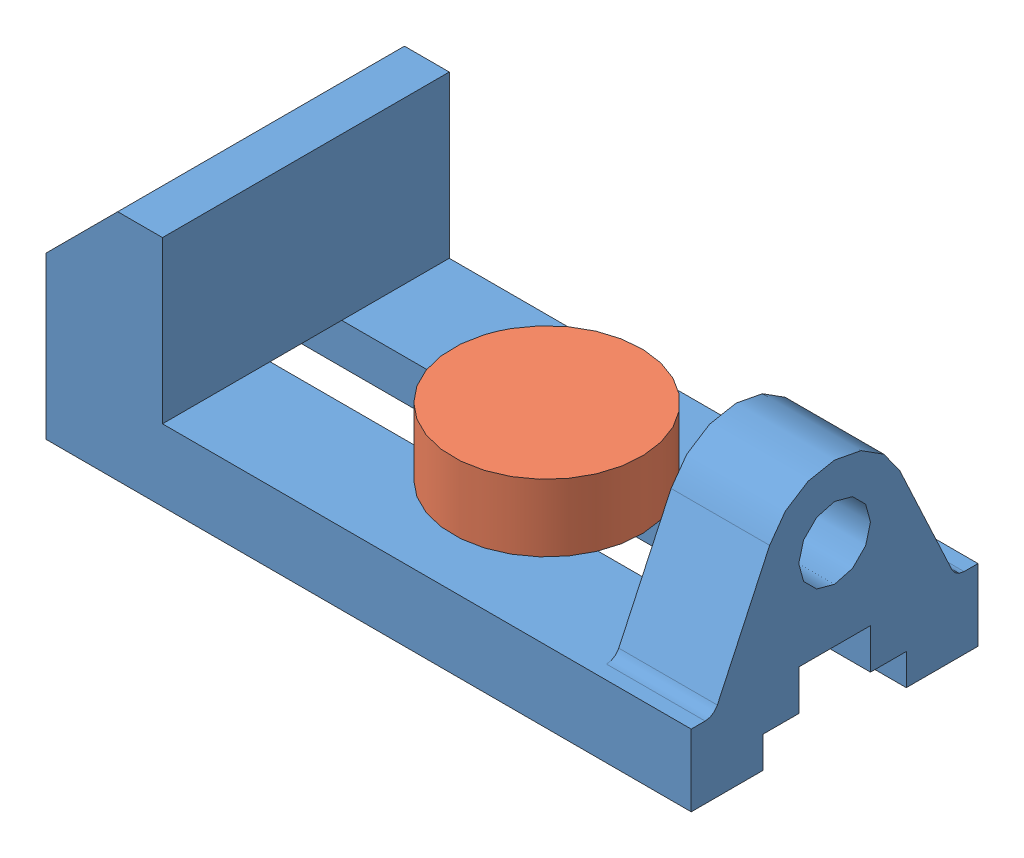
SolidWorks assembly width.SLDASM, configuration Default (file format 4400). Lengths in mm.
Overall size (144 52 64).
2 component instances, 2 part files, 2 mates.
Components (placement in the parent):
- vice-body-1: vice-body.SLDPRT [Default] at (24.2715 23.9331 8) size (144 52 64)
- Part1-1: Part1.SLDPRT [Default] at (35.337 29.9331 -21.52) x (-0.918787 0 -0.394753) z (0 1 0) size (42 42 25)
Mates (geometry in assembly coordinates):
- Coincident5: coincident anti-aligned: plane of vice-body-1 through (168.2715 39.9331 40) normal (0 1 0); plane of Part1-1 through (104.0447 39.9331 8) normal (0 -1 0)
- Tangent1: tangent anti-aligned: plane of vice-body-1 through (24.2715 30.9331 16) normal (0 0 -1); cylinder of Part1-1 through (104.0447 39.9331 8) axis (0 -1 0) radius 8
